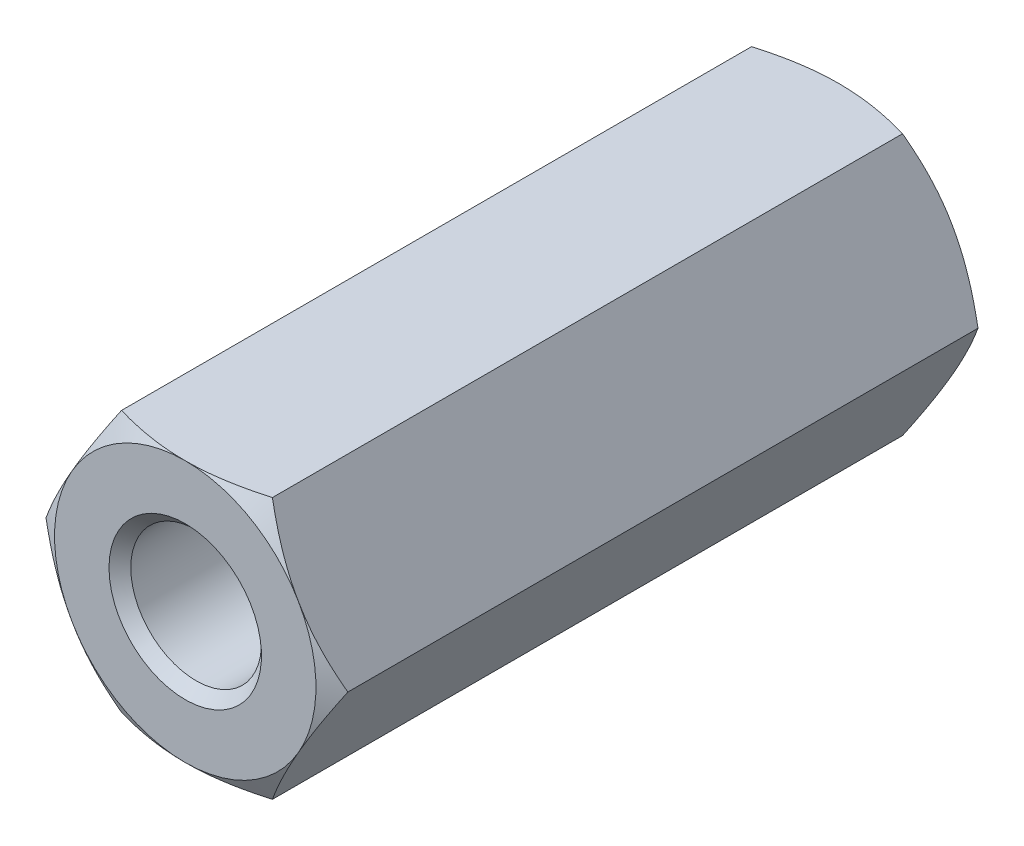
from build123d import *

# Parameters (mm, degrees)
BOSS_EXTRUDE1_DEPTH      = 7.5
SKETCH2_OUTSIDE_W        = 45.208
SKETCH2_OUTSIDE_H        = 44.28
SKETCH2_OUTSIDE_R        = 3
CUT_EXTRUDE1_DEPTH       = 9.789197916
CUT_EXTRUDE1_DRAFT       = -60
SKETCH3_R                = 1.5
SKETCH3_R_2              = 1.25
CUT_EXTRUDE2_DEPTH       = 7.5
SKETCH3_2_R              = 1.25
CUT_EXTRUDE3_DEPTH       = 8.25
CHAMFER1_SIZE            = 0.25
MIRROR1_COPY_1_SKETCH_W  = 45.208
MIRROR1_COPY_1_SKETCH_H  = 44.28
MIRROR1_COPY_1_SKETCH_R  = 3
MIRROR1_COPY_1_DEPTH     = 9.789197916
MIRROR1_COPY_1_DRAFT     = -60
CHAMFER1_OF_MIRROR1_SIZE = 0.25


with BuildPart() as part:
    # Sketch1 → Boss-Extrude1 (new body)
    with BuildSketch(Plane.XY):
        Polygon((1.732050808, 3), (-1.732050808, 3), (-3.464101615, 0), (-1.732050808, -3), (1.732050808, -3), (3.464101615, 0), align=None)
    boss_extrude1 = extrude(amount=-BOSS_EXTRUDE1_DEPTH)


with BuildPart() as cut_extrude1_tool:
    # Sketch2 outside → Cut-Extrude1 (with draft: the straight prism first)
    with BuildSketch(Plane(origin=(0, 0, -7.5), x_dir=(-1, 0, 0), z_dir=(0, 0, -1))):
        Rectangle(SKETCH2_OUTSIDE_W, SKETCH2_OUTSIDE_H)
        Circle(SKETCH2_OUTSIDE_R, mode=Mode.SUBTRACT)
    extrude(amount=-CUT_EXTRUDE1_DEPTH)
    # Cut-Extrude1: the draft: its side faces are tilted about the plane it starts from
    cut_extrude1_sides = [cut_extrude1_tool.faces().sort_by_distance(p)[0] for p in [
        (0, -22.14, -2.605401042),
        (-22.604, 0, -2.605401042),
        (0, 22.14, -2.605401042),
        (22.604, 0, -2.605401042),
        (3, 0, -2.605401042),
    ]]
    draft(cut_extrude1_sides, Plane(origin=(0, 0, -7.5), x_dir=(-1, 0, 0), z_dir=(0, 0, -1)), CUT_EXTRUDE1_DRAFT)


with BuildPart() as part_1:
    add(part.part)

    # Cut-Extrude1: cut by cut_extrude1_tool
    add(cut_extrude1_tool.part, mode=Mode.SUBTRACT)

    # Sketch3 → Cut-Extrude2 (cut)
    with BuildSketch(Plane(origin=(0, 0, -7.5), x_dir=(-1, 0, 0), z_dir=(0, 0, -1))):
        Circle(SKETCH3_R)
        Circle(SKETCH3_R_2, mode=Mode.SUBTRACT)
    cut_extrude2 = extrude(amount=-CUT_EXTRUDE2_DEPTH, mode=Mode.SUBTRACT)


with BuildPart() as cut_extrude2_piece_1:
    # of the separate pieces the step leaves, piece 1, a body of its own (cut_extrude2_pieces)
    add(part_1.part.solids().sort_by_distance((1.732050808, 3, 0))[0])

    # Chamfer1
    chamfer1_edges = [cut_extrude2_piece_1.edges().sort_by_distance(p)[0] for p in [
        (1.5, 0, -7.5),
    ]]
    chamfer(chamfer1_edges, length=CHAMFER1_SIZE)


with BuildPart() as cut_extrude2_piece_2:
    # of the separate pieces the step leaves, piece 2, a body of its own (cut_extrude2_pieces)
    add(part_1.part.solids().sort_by_distance((-1.25, 0, 0))[0])

    # Sketch3_2 → Cut-Extrude3 (cut)
    with BuildSketch(Plane(origin=(0, 0, -7.5), x_dir=(-1, 0, 0), z_dir=(0, 0, -1))):
        Circle(SKETCH3_2_R)
    cut_extrude3 = extrude(amount=-CUT_EXTRUDE3_DEPTH, mode=Mode.SUBTRACT)


with BuildPart() as cut_extrude2_piece_1_1:
    add(cut_extrude2_piece_1.part)

    # Mirror1: Boss-Extrude1, Cut-Extrude2, Cut-Extrude3 across plane
    add(boss_extrude1.mirror(Plane.XY))
    add(cut_extrude2.mirror(Plane.XY), mode=Mode.SUBTRACT)
    add(cut_extrude3.mirror(Plane.XY), mode=Mode.SUBTRACT)


with BuildPart() as mirror1_copy_1_tool:
    # Mirror1 copy 1 sketch → Mirror1 copy 1 (with draft: the straight prism first)
    with BuildSketch(Plane(origin=(0, 0, 7.5), x_dir=(-1, 0, 0), z_dir=(0, 0, 1))):
        Rectangle(MIRROR1_COPY_1_SKETCH_W, MIRROR1_COPY_1_SKETCH_H)
        Circle(MIRROR1_COPY_1_SKETCH_R, mode=Mode.SUBTRACT)
    extrude(amount=-MIRROR1_COPY_1_DEPTH)
    # Mirror1 copy 1: the draft: its side faces are tilted about the plane it starts from
    mirror1_copy_1_sides = [mirror1_copy_1_tool.faces().sort_by_distance(p)[0] for p in [
        (0, -22.14, 2.605401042),
        (-22.604, 0, 2.605401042),
        (0, 22.14, 2.605401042),
        (22.604, 0, 2.605401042),
        (3, 0, 2.605401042),
    ]]
    draft(mirror1_copy_1_sides, Plane(origin=(0, 0, 7.5), x_dir=(-1, 0, 0), z_dir=(0, 0, 1)), MIRROR1_COPY_1_DRAFT)


with BuildPart() as cut_extrude2_piece_1_2:
    add(cut_extrude2_piece_1_1.part)

    # Mirror1 copy 1: cut by mirror1_copy_1_tool
    add(mirror1_copy_1_tool.part, mode=Mode.SUBTRACT)

    # Chamfer1 of Mirror1
    chamfer1_of_mirror1_edges = [cut_extrude2_piece_1_2.edges().sort_by_distance(p)[0] for p in [
        (1.5, 0, 7.5),
    ]]
    chamfer(chamfer1_of_mirror1_edges, length=CHAMFER1_OF_MIRROR1_SIZE)


solid = cut_extrude2_piece_1_2.part
